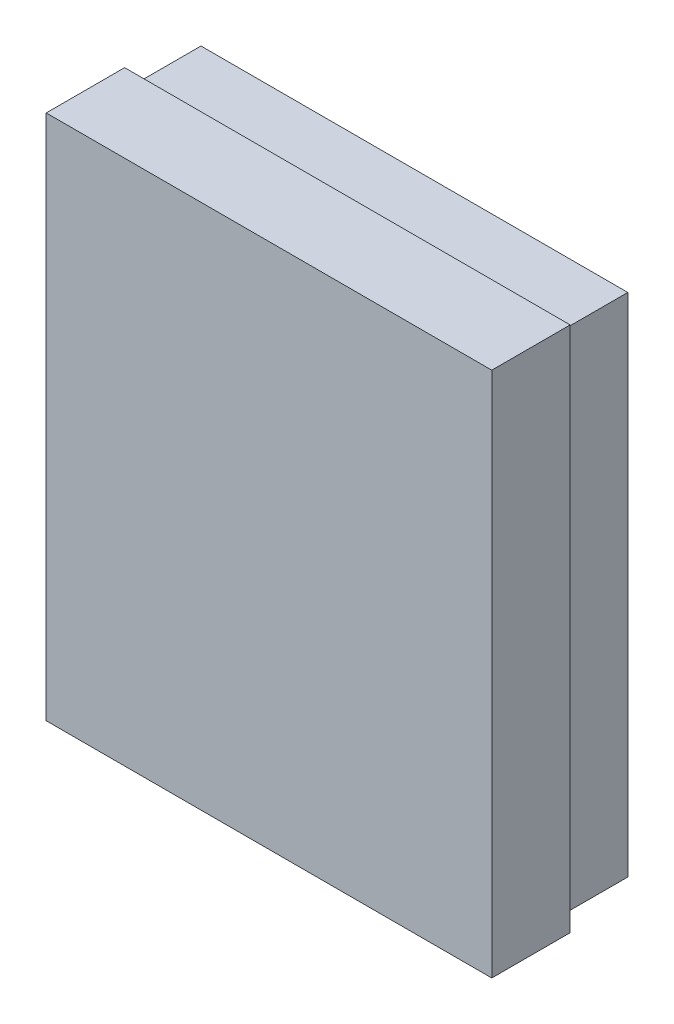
ISO-10303-21;
HEADER;
FILE_DESCRIPTION(('STEP AP214'),'2;1');
FILE_NAME('part.step','',(''),(''),'','','');
FILE_SCHEMA(('AUTOMOTIVE_DESIGN { 1 0 10303 214 1 1 1 1 }'));
ENDSEC;
DATA;
#1=APPLICATION_CONTEXT('core data for automotive mechanical design processes');
#2=APPLICATION_PROTOCOL_DEFINITION('international standard','automotive_design',2000,#1);
#3=PRODUCT_CONTEXT('',#1,'mechanical');
#4=PRODUCT('Part','Part','',(#3));
#5=PRODUCT_RELATED_PRODUCT_CATEGORY('part','',(#4));
#6=PRODUCT_DEFINITION_FORMATION('','',#4);
#7=PRODUCT_DEFINITION_CONTEXT('part definition',#1,'design');
#8=PRODUCT_DEFINITION('design','',#6,#7);
#9=PRODUCT_DEFINITION_SHAPE('','',#8);
#10=(LENGTH_UNIT() NAMED_UNIT(*) SI_UNIT(.MILLI.,.METRE.));
#11=(NAMED_UNIT(*) PLANE_ANGLE_UNIT() SI_UNIT($,.RADIAN.));
#12=(NAMED_UNIT(*) SI_UNIT($,.STERADIAN.) SOLID_ANGLE_UNIT());
#13=UNCERTAINTY_MEASURE_WITH_UNIT(LENGTH_MEASURE(1.E-05),#10,'distance_accuracy_value','');
#14=(GEOMETRIC_REPRESENTATION_CONTEXT(3) GLOBAL_UNCERTAINTY_ASSIGNED_CONTEXT((#13)) GLOBAL_UNIT_ASSIGNED_CONTEXT((#10,
#11,#12)) REPRESENTATION_CONTEXT('',''));
#15=CARTESIAN_POINT('',(0.,0.,0.));
#16=DIRECTION('',(0.,0.,1.));
#17=DIRECTION('',(1.,0.,0.));
#18=AXIS2_PLACEMENT_3D('',#15,#16,#17);
#19=CARTESIAN_POINT('',(-9.57990146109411,14.9539925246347,3.2766));
#20=DIRECTION('',(1.,0.,0.));
#21=DIRECTION('',(0.,0.,-1.));
#22=AXIS2_PLACEMENT_3D('',#19,#20,#21);
#23=PLANE('',#22);
#24=DIRECTION('',(0.,-1.,0.));
#25=VECTOR('',#24,1.);
#26=CARTESIAN_POINT('',(-9.57990146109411,14.9539925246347,3.2766));
#27=LINE('',#26,#25);
#28=CARTESIAN_POINT('',(-9.57990146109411,7.60837419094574,3.2766));
#29=VERTEX_POINT('',#28);
#30=CARTESIAN_POINT('',(-9.57990146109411,-9.81100747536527,3.2766));
#31=VERTEX_POINT('',#30);
#32=EDGE_CURVE('E217',#29,#31,#27,.T.);
#33=ORIENTED_EDGE('',*,*,#32,.F.);
#34=DIRECTION('',(0.,0.,-1.));
#35=VECTOR('',#34,1.);
#36=CARTESIAN_POINT('',(-9.57990146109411,7.60837419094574,3.2766));
#37=LINE('',#36,#35);
#38=CARTESIAN_POINT('',(-9.57990146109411,7.60837419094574,1.9671849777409));
#39=VERTEX_POINT('',#38);
#40=EDGE_CURVE('E175',#29,#39,#37,.T.);
#41=ORIENTED_EDGE('',*,*,#40,.T.);
#42=DIRECTION('',(0.,1.,0.));
#43=VECTOR('',#42,1.);
#44=CARTESIAN_POINT('',(-9.57990146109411,14.9539925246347,1.9671849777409));
#45=LINE('',#44,#43);
#46=CARTESIAN_POINT('',(-9.57990146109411,14.7073349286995,1.9671849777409));
#47=VERTEX_POINT('',#46);
#48=EDGE_CURVE('E11',#39,#47,#45,.T.);
#49=ORIENTED_EDGE('',*,*,#48,.T.);
#50=DIRECTION('',(0.,0.,1.));
#51=VECTOR('',#50,1.);
#52=CARTESIAN_POINT('',(-9.57990146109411,14.7073349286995,3.2766));
#53=LINE('',#52,#51);
#54=CARTESIAN_POINT('',(-9.57990146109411,14.7073349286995,3.2766));
#55=VERTEX_POINT('',#54);
#56=EDGE_CURVE('E171',#47,#55,#53,.T.);
#57=ORIENTED_EDGE('',*,*,#56,.T.);
#58=CARTESIAN_POINT('',(-9.57990146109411,14.9539925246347,3.2766));
#59=VERTEX_POINT('',#58);
#60=EDGE_CURVE('E218',#59,#55,#27,.T.);
#61=ORIENTED_EDGE('',*,*,#60,.F.);
#62=DIRECTION('',(0.,0.,-1.));
#63=VECTOR('',#62,1.);
#64=CARTESIAN_POINT('',(-9.57990146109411,14.9539925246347,3.2766));
#65=LINE('',#64,#63);
#66=CARTESIAN_POINT('',(-9.57990146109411,14.9539925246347,0.));
#67=VERTEX_POINT('',#66);
#68=EDGE_CURVE('E230',#59,#67,#65,.T.);
#69=ORIENTED_EDGE('',*,*,#68,.T.);
#70=DIRECTION('',(0.,-1.,0.));
#71=VECTOR('',#70,1.);
#72=CARTESIAN_POINT('',(-9.57990146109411,14.9539925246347,0.));
#73=LINE('',#72,#71);
#74=CARTESIAN_POINT('',(-9.57990146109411,-9.81100747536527,0.));
#75=VERTEX_POINT('',#74);
#76=EDGE_CURVE('E208',#67,#75,#73,.T.);
#77=ORIENTED_EDGE('',*,*,#76,.T.);
#78=DIRECTION('',(0.,0.,-1.));
#79=VECTOR('',#78,1.);
#80=CARTESIAN_POINT('',(-9.57990146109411,-9.81100747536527,3.2766));
#81=LINE('',#80,#79);
#82=EDGE_CURVE('E138',#31,#75,#81,.T.);
#83=ORIENTED_EDGE('',*,*,#82,.F.);
#84=EDGE_LOOP('',(#33,#41,#49,#57,#61,#69,#77,#83));
#85=FACE_BOUND('',#84,.T.);
#86=ADVANCED_FACE('F29',(#85),#23,.F.);
#87=CARTESIAN_POINT('',(-9.57990146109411,-9.81100747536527,3.2766));
#88=DIRECTION('',(0.,1.,0.));
#89=DIRECTION('',(0.,0.,1.));
#90=AXIS2_PLACEMENT_3D('',#87,#88,#89);
#91=PLANE('',#90);
#92=DIRECTION('',(1.,0.,0.));
#93=VECTOR('',#92,1.);
#94=CARTESIAN_POINT('',(-9.57990146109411,-9.81100747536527,0.));
#95=LINE('',#94,#93);
#96=CARTESIAN_POINT('',(11.2988985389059,-9.81100747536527,0.));
#97=VERTEX_POINT('',#96);
#98=EDGE_CURVE('E211',#75,#97,#95,.T.);
#99=ORIENTED_EDGE('',*,*,#98,.T.);
#100=DIRECTION('',(0.,0.,-1.));
#101=VECTOR('',#100,1.);
#102=CARTESIAN_POINT('',(11.2988985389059,-9.81100747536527,3.2766));
#103=LINE('',#102,#101);
#104=CARTESIAN_POINT('',(11.2988985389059,-9.81100747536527,3.2766));
#105=VERTEX_POINT('',#104);
#106=EDGE_CURVE('E234',#105,#97,#103,.T.);
#107=ORIENTED_EDGE('',*,*,#106,.F.);
#108=DIRECTION('',(1.,0.,0.));
#109=VECTOR('',#108,1.);
#110=CARTESIAN_POINT('',(-9.57990146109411,-9.81100747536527,3.2766));
#111=LINE('',#110,#109);
#112=EDGE_CURVE('E221',#31,#105,#111,.T.);
#113=ORIENTED_EDGE('',*,*,#112,.F.);
#114=ORIENTED_EDGE('',*,*,#82,.T.);
#115=EDGE_LOOP('',(#99,#107,#113,#114));
#116=FACE_BOUND('',#115,.T.);
#117=ADVANCED_FACE('F241',(#116),#91,.F.);
#118=CARTESIAN_POINT('',(11.2988985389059,14.9539925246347,3.2766));
#119=DIRECTION('',(-1.,0.,0.));
#120=DIRECTION('',(0.,-1.,0.));
#121=AXIS2_PLACEMENT_3D('',#118,#119,#120);
#122=PLANE('',#121);
#123=DIRECTION('',(0.,1.,0.));
#124=VECTOR('',#123,1.);
#125=CARTESIAN_POINT('',(11.2988985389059,14.9539925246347,0.));
#126=LINE('',#125,#124);
#127=CARTESIAN_POINT('',(11.2988985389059,14.9539925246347,0.));
#128=VERTEX_POINT('',#127);
#129=EDGE_CURVE('E213',#97,#128,#126,.T.);
#130=ORIENTED_EDGE('',*,*,#129,.T.);
#131=DIRECTION('',(0.,0.,-1.));
#132=VECTOR('',#131,1.);
#133=CARTESIAN_POINT('',(11.2988985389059,14.9539925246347,3.2766));
#134=LINE('',#133,#132);
#135=CARTESIAN_POINT('',(11.2988985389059,14.9539925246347,3.2766));
#136=VERTEX_POINT('',#135);
#137=EDGE_CURVE('E51',#136,#128,#134,.T.);
#138=ORIENTED_EDGE('',*,*,#137,.F.);
#139=DIRECTION('',(0.,1.,0.));
#140=VECTOR('',#139,1.);
#141=CARTESIAN_POINT('',(11.2988985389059,14.9539925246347,3.2766));
#142=LINE('',#141,#140);
#143=EDGE_CURVE('E224',#105,#136,#142,.T.);
#144=ORIENTED_EDGE('',*,*,#143,.F.);
#145=ORIENTED_EDGE('',*,*,#106,.T.);
#146=EDGE_LOOP('',(#130,#138,#144,#145));
#147=FACE_BOUND('',#146,.T.);
#148=ADVANCED_FACE('F250',(#147),#122,.F.);
#149=CARTESIAN_POINT('',(-9.57990146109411,14.9539925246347,3.2766));
#150=DIRECTION('',(0.,-1.,0.));
#151=DIRECTION('',(0.,0.,-1.));
#152=AXIS2_PLACEMENT_3D('',#149,#150,#151);
#153=PLANE('',#152);
#154=DIRECTION('',(-1.,0.,0.));
#155=VECTOR('',#154,1.);
#156=CARTESIAN_POINT('',(-9.57990146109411,14.9539925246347,0.));
#157=LINE('',#156,#155);
#158=EDGE_CURVE('E215',#128,#67,#157,.T.);
#159=ORIENTED_EDGE('',*,*,#158,.T.);
#160=ORIENTED_EDGE('',*,*,#68,.F.);
#161=DIRECTION('',(-1.,0.,0.));
#162=VECTOR('',#161,1.);
#163=CARTESIAN_POINT('',(-9.57990146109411,14.9539925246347,3.2766));
#164=LINE('',#163,#162);
#165=EDGE_CURVE('E227',#136,#59,#164,.T.);
#166=ORIENTED_EDGE('',*,*,#165,.F.);
#167=ORIENTED_EDGE('',*,*,#137,.T.);
#168=EDGE_LOOP('',(#159,#160,#166,#167));
#169=FACE_BOUND('',#168,.T.);
#170=ADVANCED_FACE('F252',(#169),#153,.F.);
#171=CARTESIAN_POINT('',(-9.57990146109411,-9.81100747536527,0.));
#172=DIRECTION('',(0.,0.,1.));
#173=DIRECTION('',(1.,0.,0.));
#174=AXIS2_PLACEMENT_3D('',#171,#172,#173);
#175=PLANE('',#174);
#176=ORIENTED_EDGE('',*,*,#76,.F.);
#177=ORIENTED_EDGE('',*,*,#158,.F.);
#178=ORIENTED_EDGE('',*,*,#129,.F.);
#179=ORIENTED_EDGE('',*,*,#98,.F.);
#180=EDGE_LOOP('',(#176,#177,#178,#179));
#181=FACE_BOUND('',#180,.T.);
#182=ADVANCED_FACE('F248',(#181),#175,.F.);
#183=CARTESIAN_POINT('',(-10.0377746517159,-10.3032781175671,3.2766));
#184=DIRECTION('',(0.,0.,1.));
#185=DIRECTION('',(1.,0.,0.));
#186=AXIS2_PLACEMENT_3D('',#183,#184,#185);
#187=PLANE('',#186);
#188=DIRECTION('',(0.,-1.,0.));
#189=VECTOR('',#188,1.);
#190=CARTESIAN_POINT('',(-10.0377746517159,15.4462631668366,3.2766));
#191=LINE('',#190,#189);
#192=CARTESIAN_POINT('',(-10.0377746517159,7.60837419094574,3.2766));
#193=VERTEX_POINT('',#192);
#194=CARTESIAN_POINT('',(-10.0377746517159,-10.3032781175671,3.2766));
#195=VERTEX_POINT('',#194);
#196=EDGE_CURVE('E178',#193,#195,#191,.T.);
#197=ORIENTED_EDGE('',*,*,#196,.F.);
#198=DIRECTION('',(1.,0.,0.));
#199=VECTOR('',#198,1.);
#200=CARTESIAN_POINT('',(-10.0377746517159,7.60837419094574,3.2766));
#201=LINE('',#200,#199);
#202=EDGE_CURVE('E135',#193,#29,#201,.T.);
#203=ORIENTED_EDGE('',*,*,#202,.T.);
#204=ORIENTED_EDGE('',*,*,#32,.T.);
#205=ORIENTED_EDGE('',*,*,#112,.T.);
#206=ORIENTED_EDGE('',*,*,#143,.T.);
#207=ORIENTED_EDGE('',*,*,#165,.T.);
#208=ORIENTED_EDGE('',*,*,#60,.T.);
#209=DIRECTION('',(-1.,0.,0.));
#210=VECTOR('',#209,1.);
#211=CARTESIAN_POINT('',(-10.0377746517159,14.7073349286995,3.2766));
#212=LINE('',#211,#210);
#213=CARTESIAN_POINT('',(-10.0377746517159,14.7073349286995,3.2766));
#214=VERTEX_POINT('',#213);
#215=EDGE_CURVE('E143',#55,#214,#212,.T.);
#216=ORIENTED_EDGE('',*,*,#215,.T.);
#217=CARTESIAN_POINT('',(-10.0377746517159,15.4462631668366,3.2766));
#218=VERTEX_POINT('',#217);
#219=EDGE_CURVE('E179',#218,#214,#191,.T.);
#220=ORIENTED_EDGE('',*,*,#219,.F.);
#221=DIRECTION('',(-1.,0.,0.));
#222=VECTOR('',#221,1.);
#223=CARTESIAN_POINT('',(-10.0377746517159,15.4462631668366,3.2766));
#224=LINE('',#223,#222);
#225=CARTESIAN_POINT('',(11.7567717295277,15.4462631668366,3.2766));
#226=VERTEX_POINT('',#225);
#227=EDGE_CURVE('E185',#226,#218,#224,.T.);
#228=ORIENTED_EDGE('',*,*,#227,.F.);
#229=DIRECTION('',(0.,1.,0.));
#230=VECTOR('',#229,1.);
#231=CARTESIAN_POINT('',(11.7567717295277,15.4462631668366,3.2766));
#232=LINE('',#231,#230);
#233=CARTESIAN_POINT('',(11.7567717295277,-10.3032781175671,3.2766));
#234=VERTEX_POINT('',#233);
#235=EDGE_CURVE('E183',#234,#226,#232,.T.);
#236=ORIENTED_EDGE('',*,*,#235,.F.);
#237=DIRECTION('',(1.,0.,0.));
#238=VECTOR('',#237,1.);
#239=CARTESIAN_POINT('',(-10.0377746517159,-10.3032781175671,3.2766));
#240=LINE('',#239,#238);
#241=EDGE_CURVE('E181',#195,#234,#240,.T.);
#242=ORIENTED_EDGE('',*,*,#241,.F.);
#243=EDGE_LOOP('',(#197,#203,#204,#205,#206,#207,#208,#216,#220,#228,#236,#242));
#244=FACE_BOUND('',#243,.T.);
#245=ADVANCED_FACE('F254',(#244),#187,.F.);
#246=CARTESIAN_POINT('',(-10.0377746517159,15.4462631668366,7.112));
#247=DIRECTION('',(1.,0.,0.));
#248=DIRECTION('',(0.,1.,0.));
#249=AXIS2_PLACEMENT_3D('',#246,#247,#248);
#250=PLANE('',#249);
#251=DIRECTION('',(0.,1.,0.));
#252=VECTOR('',#251,1.);
#253=CARTESIAN_POINT('',(-10.0377746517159,14.7073349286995,6.56460716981));
#254=LINE('',#253,#252);
#255=CARTESIAN_POINT('',(-10.0377746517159,7.60837419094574,6.56460716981));
#256=VERTEX_POINT('',#255);
#257=CARTESIAN_POINT('',(-10.0377746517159,14.7073349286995,6.56460716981));
#258=VERTEX_POINT('',#257);
#259=EDGE_CURVE('E43',#256,#258,#254,.T.);
#260=ORIENTED_EDGE('',*,*,#259,.F.);
#261=DIRECTION('',(0.,0.,-1.));
#262=VECTOR('',#261,1.);
#263=CARTESIAN_POINT('',(-10.0377746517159,7.60837419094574,7.112));
#264=LINE('',#263,#262);
#265=EDGE_CURVE('E36',#256,#193,#264,.T.);
#266=ORIENTED_EDGE('',*,*,#265,.T.);
#267=ORIENTED_EDGE('',*,*,#196,.T.);
#268=DIRECTION('',(0.,0.,-1.));
#269=VECTOR('',#268,1.);
#270=CARTESIAN_POINT('',(-10.0377746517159,-10.3032781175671,7.112));
#271=LINE('',#270,#269);
#272=CARTESIAN_POINT('',(-10.0377746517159,-10.3032781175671,7.112));
#273=VERTEX_POINT('',#272);
#274=EDGE_CURVE('E205',#273,#195,#271,.T.);
#275=ORIENTED_EDGE('',*,*,#274,.F.);
#276=DIRECTION('',(0.,-1.,0.));
#277=VECTOR('',#276,1.);
#278=CARTESIAN_POINT('',(-10.0377746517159,15.4462631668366,7.112));
#279=LINE('',#278,#277);
#280=CARTESIAN_POINT('',(-10.0377746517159,15.4462631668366,7.112));
#281=VERTEX_POINT('',#280);
#282=EDGE_CURVE('E187',#281,#273,#279,.T.);
#283=ORIENTED_EDGE('',*,*,#282,.F.);
#284=DIRECTION('',(0.,0.,-1.));
#285=VECTOR('',#284,1.);
#286=CARTESIAN_POINT('',(-10.0377746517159,15.4462631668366,7.112));
#287=LINE('',#286,#285);
#288=EDGE_CURVE('E196',#281,#218,#287,.T.);
#289=ORIENTED_EDGE('',*,*,#288,.T.);
#290=ORIENTED_EDGE('',*,*,#219,.T.);
#291=DIRECTION('',(0.,0.,-1.));
#292=VECTOR('',#291,1.);
#293=CARTESIAN_POINT('',(-10.0377746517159,14.7073349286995,6.56460716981));
#294=LINE('',#293,#292);
#295=EDGE_CURVE('E149',#258,#214,#294,.T.);
#296=ORIENTED_EDGE('',*,*,#295,.F.);
#297=EDGE_LOOP('',(#260,#266,#267,#275,#283,#289,#290,#296));
#298=FACE_BOUND('',#297,.T.);
#299=ADVANCED_FACE('F147',(#298),#250,.F.);
#300=CARTESIAN_POINT('',(-10.0377746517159,-10.3032781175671,7.112));
#301=DIRECTION('',(0.,1.,0.));
#302=DIRECTION('',(-1.,0.,0.));
#303=AXIS2_PLACEMENT_3D('',#300,#301,#302);
#304=PLANE('',#303);
#305=ORIENTED_EDGE('',*,*,#241,.T.);
#306=DIRECTION('',(0.,0.,-1.));
#307=VECTOR('',#306,1.);
#308=CARTESIAN_POINT('',(11.7567717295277,-10.3032781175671,7.112));
#309=LINE('',#308,#307);
#310=CARTESIAN_POINT('',(11.7567717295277,-10.3032781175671,7.112));
#311=VERTEX_POINT('',#310);
#312=EDGE_CURVE('E202',#311,#234,#309,.T.);
#313=ORIENTED_EDGE('',*,*,#312,.F.);
#314=DIRECTION('',(1.,0.,0.));
#315=VECTOR('',#314,1.);
#316=CARTESIAN_POINT('',(-10.0377746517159,-10.3032781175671,7.112));
#317=LINE('',#316,#315);
#318=EDGE_CURVE('E190',#273,#311,#317,.T.);
#319=ORIENTED_EDGE('',*,*,#318,.F.);
#320=ORIENTED_EDGE('',*,*,#274,.T.);
#321=EDGE_LOOP('',(#305,#313,#319,#320));
#322=FACE_BOUND('',#321,.T.);
#323=ADVANCED_FACE('F279',(#322),#304,.F.);
#324=CARTESIAN_POINT('',(11.7567717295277,15.4462631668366,7.112));
#325=DIRECTION('',(-1.,0.,0.));
#326=DIRECTION('',(0.,0.,1.));
#327=AXIS2_PLACEMENT_3D('',#324,#325,#326);
#328=PLANE('',#327);
#329=ORIENTED_EDGE('',*,*,#235,.T.);
#330=DIRECTION('',(0.,0.,-1.));
#331=VECTOR('',#330,1.);
#332=CARTESIAN_POINT('',(11.7567717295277,15.4462631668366,7.112));
#333=LINE('',#332,#331);
#334=CARTESIAN_POINT('',(11.7567717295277,15.4462631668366,7.112));
#335=VERTEX_POINT('',#334);
#336=EDGE_CURVE('E199',#335,#226,#333,.T.);
#337=ORIENTED_EDGE('',*,*,#336,.F.);
#338=DIRECTION('',(0.,1.,0.));
#339=VECTOR('',#338,1.);
#340=CARTESIAN_POINT('',(11.7567717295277,15.4462631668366,7.112));
#341=LINE('',#340,#339);
#342=EDGE_CURVE('E192',#311,#335,#341,.T.);
#343=ORIENTED_EDGE('',*,*,#342,.F.);
#344=ORIENTED_EDGE('',*,*,#312,.T.);
#345=EDGE_LOOP('',(#329,#337,#343,#344));
#346=FACE_BOUND('',#345,.T.);
#347=ADVANCED_FACE('F275',(#346),#328,.F.);
#348=CARTESIAN_POINT('',(-10.0377746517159,15.4462631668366,7.112));
#349=DIRECTION('',(0.,-1.,0.));
#350=DIRECTION('',(1.,0.,0.));
#351=AXIS2_PLACEMENT_3D('',#348,#349,#350);
#352=PLANE('',#351);
#353=ORIENTED_EDGE('',*,*,#227,.T.);
#354=ORIENTED_EDGE('',*,*,#288,.F.);
#355=DIRECTION('',(-1.,0.,0.));
#356=VECTOR('',#355,1.);
#357=CARTESIAN_POINT('',(-10.0377746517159,15.4462631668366,7.112));
#358=LINE('',#357,#356);
#359=EDGE_CURVE('E194',#335,#281,#358,.T.);
#360=ORIENTED_EDGE('',*,*,#359,.F.);
#361=ORIENTED_EDGE('',*,*,#336,.T.);
#362=EDGE_LOOP('',(#353,#354,#360,#361));
#363=FACE_BOUND('',#362,.T.);
#364=ADVANCED_FACE('F270',(#363),#352,.F.);
#365=CARTESIAN_POINT('',(-10.0377746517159,-10.3032781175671,7.112));
#366=DIRECTION('',(0.,0.,1.));
#367=DIRECTION('',(1.,0.,0.));
#368=AXIS2_PLACEMENT_3D('',#365,#366,#367);
#369=PLANE('',#368);
#370=ORIENTED_EDGE('',*,*,#282,.T.);
#371=ORIENTED_EDGE('',*,*,#318,.T.);
#372=ORIENTED_EDGE('',*,*,#342,.T.);
#373=ORIENTED_EDGE('',*,*,#359,.T.);
#374=EDGE_LOOP('',(#370,#371,#372,#373));
#375=FACE_BOUND('',#374,.T.);
#376=ADVANCED_FACE('F281',(#375),#369,.T.);
#377=CARTESIAN_POINT('',(-9.22875761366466,14.7073349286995,1.9671849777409));
#378=DIRECTION('',(0.,0.,-1.));
#379=DIRECTION('',(-1.,0.,0.));
#380=AXIS2_PLACEMENT_3D('',#377,#378,#379);
#381=PLANE('',#380);
#382=DIRECTION('',(-1.,0.,0.));
#383=VECTOR('',#382,1.);
#384=CARTESIAN_POINT('',(-9.22875761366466,7.60837419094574,1.9671849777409));
#385=LINE('',#384,#383);
#386=CARTESIAN_POINT('',(-9.22875761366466,7.60837419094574,1.9671849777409));
#387=VERTEX_POINT('',#386);
#388=EDGE_CURVE('E144',#387,#39,#385,.T.);
#389=ORIENTED_EDGE('',*,*,#388,.F.);
#390=DIRECTION('',(0.,-1.,0.));
#391=VECTOR('',#390,1.);
#392=CARTESIAN_POINT('',(-9.22875761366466,14.7073349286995,1.9671849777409));
#393=LINE('',#392,#391);
#394=CARTESIAN_POINT('',(-9.22875761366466,14.7073349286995,1.9671849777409));
#395=VERTEX_POINT('',#394);
#396=EDGE_CURVE('E157',#395,#387,#393,.T.);
#397=ORIENTED_EDGE('',*,*,#396,.F.);
#398=DIRECTION('',(-1.,0.,0.));
#399=VECTOR('',#398,1.);
#400=CARTESIAN_POINT('',(-9.22875761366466,14.7073349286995,1.9671849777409));
#401=LINE('',#400,#399);
#402=EDGE_CURVE('E165',#395,#47,#401,.T.);
#403=ORIENTED_EDGE('',*,*,#402,.T.);
#404=ORIENTED_EDGE('',*,*,#48,.F.);
#405=EDGE_LOOP('',(#389,#397,#403,#404));
#406=FACE_BOUND('',#405,.T.);
#407=ADVANCED_FACE('F257',(#406),#381,.F.);
#408=CARTESIAN_POINT('',(-9.22875761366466,7.60837419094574,6.56460716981));
#409=DIRECTION('',(0.,-1.,0.));
#410=DIRECTION('',(1.,0.,0.));
#411=AXIS2_PLACEMENT_3D('',#408,#409,#410);
#412=PLANE('',#411);
#413=ORIENTED_EDGE('',*,*,#202,.F.);
#414=ORIENTED_EDGE('',*,*,#265,.F.);
#415=DIRECTION('',(-1.,0.,0.));
#416=VECTOR('',#415,1.);
#417=CARTESIAN_POINT('',(-9.22875761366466,7.60837419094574,6.56460716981));
#418=LINE('',#417,#416);
#419=CARTESIAN_POINT('',(-9.22875761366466,7.60837419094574,6.56460716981));
#420=VERTEX_POINT('',#419);
#421=EDGE_CURVE('E132',#420,#256,#418,.T.);
#422=ORIENTED_EDGE('',*,*,#421,.F.);
#423=DIRECTION('',(0.,0.,1.));
#424=VECTOR('',#423,1.);
#425=CARTESIAN_POINT('',(-9.22875761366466,7.60837419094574,6.56460716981));
#426=LINE('',#425,#424);
#427=EDGE_CURVE('E160',#387,#420,#426,.T.);
#428=ORIENTED_EDGE('',*,*,#427,.F.);
#429=ORIENTED_EDGE('',*,*,#388,.T.);
#430=ORIENTED_EDGE('',*,*,#40,.F.);
#431=EDGE_LOOP('',(#413,#414,#422,#428,#429,#430));
#432=FACE_BOUND('',#431,.T.);
#433=ADVANCED_FACE('F130',(#432),#412,.F.);
#434=CARTESIAN_POINT('',(-9.22875761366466,14.7073349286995,6.56460716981));
#435=DIRECTION('',(0.,1.,0.));
#436=DIRECTION('',(-1.,0.,0.));
#437=AXIS2_PLACEMENT_3D('',#434,#435,#436);
#438=PLANE('',#437);
#439=ORIENTED_EDGE('',*,*,#402,.F.);
#440=DIRECTION('',(0.,0.,-1.));
#441=VECTOR('',#440,1.);
#442=CARTESIAN_POINT('',(-9.22875761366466,14.7073349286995,6.56460716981));
#443=LINE('',#442,#441);
#444=CARTESIAN_POINT('',(-9.22875761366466,14.7073349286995,6.56460716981));
#445=VERTEX_POINT('',#444);
#446=EDGE_CURVE('E154',#445,#395,#443,.T.);
#447=ORIENTED_EDGE('',*,*,#446,.F.);
#448=DIRECTION('',(-1.,0.,0.));
#449=VECTOR('',#448,1.);
#450=CARTESIAN_POINT('',(-9.22875761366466,14.7073349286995,6.56460716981));
#451=LINE('',#450,#449);
#452=EDGE_CURVE('E161',#445,#258,#451,.T.);
#453=ORIENTED_EDGE('',*,*,#452,.T.);
#454=ORIENTED_EDGE('',*,*,#295,.T.);
#455=ORIENTED_EDGE('',*,*,#215,.F.);
#456=ORIENTED_EDGE('',*,*,#56,.F.);
#457=EDGE_LOOP('',(#439,#447,#453,#454,#455,#456));
#458=FACE_BOUND('',#457,.T.);
#459=ADVANCED_FACE('F262',(#458),#438,.F.);
#460=CARTESIAN_POINT('',(-9.22875761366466,14.7073349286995,6.56460716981));
#461=DIRECTION('',(0.,0.,1.));
#462=DIRECTION('',(1.,0.,0.));
#463=AXIS2_PLACEMENT_3D('',#460,#461,#462);
#464=PLANE('',#463);
#465=ORIENTED_EDGE('',*,*,#259,.T.);
#466=ORIENTED_EDGE('',*,*,#452,.F.);
#467=DIRECTION('',(0.,1.,0.));
#468=VECTOR('',#467,1.);
#469=CARTESIAN_POINT('',(-9.22875761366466,14.7073349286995,6.56460716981));
#470=LINE('',#469,#468);
#471=EDGE_CURVE('E141',#420,#445,#470,.T.);
#472=ORIENTED_EDGE('',*,*,#471,.F.);
#473=ORIENTED_EDGE('',*,*,#421,.T.);
#474=EDGE_LOOP('',(#465,#466,#472,#473));
#475=FACE_BOUND('',#474,.T.);
#476=ADVANCED_FACE('F139',(#475),#464,.F.);
#477=CARTESIAN_POINT('',(-9.22875761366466,7.60837419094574,6.56460716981));
#478=DIRECTION('',(1.,0.,0.));
#479=DIRECTION('',(0.,1.,0.));
#480=AXIS2_PLACEMENT_3D('',#477,#478,#479);
#481=PLANE('',#480);
#482=ORIENTED_EDGE('',*,*,#471,.T.);
#483=ORIENTED_EDGE('',*,*,#446,.T.);
#484=ORIENTED_EDGE('',*,*,#396,.T.);
#485=ORIENTED_EDGE('',*,*,#427,.T.);
#486=EDGE_LOOP('',(#482,#483,#484,#485));
#487=FACE_BOUND('',#486,.T.);
#488=ADVANCED_FACE('F259',(#487),#481,.F.);
#489=CLOSED_SHELL('',(#86,#117,#148,#170,#182,#245,#299,#323,#347,#364,#376,#407,#433,#459,#476,#488));
#490=MANIFOLD_SOLID_BREP('B2',#489);
#491=ADVANCED_BREP_SHAPE_REPRESENTATION('',(#18,#490),#14);
#492=SHAPE_DEFINITION_REPRESENTATION(#9,#491);
ENDSEC;
END-ISO-10303-21;
